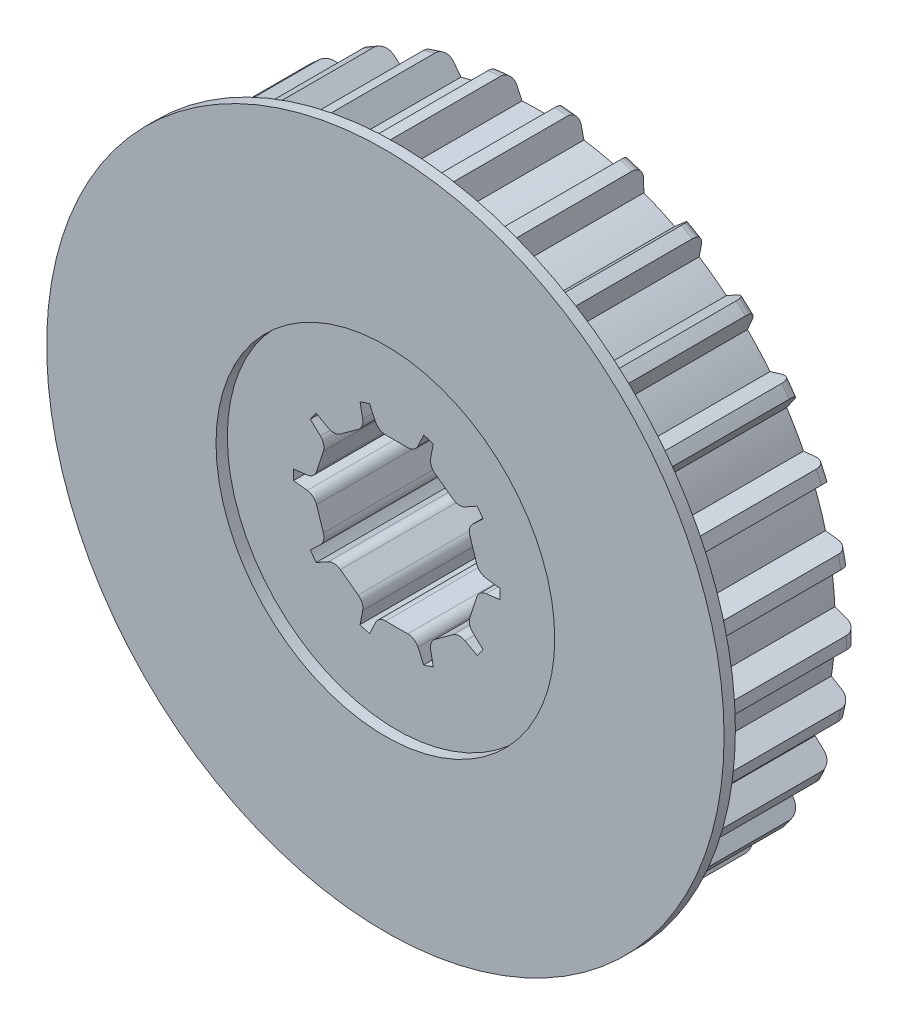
from build123d import *

# Parameters (mm, degrees)
SCHNITT_LINEAR_AUSTRAGEN1_DEPTH = 22.193366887
KREISMUSTER1_COUNT              = 30
AUFSATZ_LINEAR_AUSTRAGEN1_DEPTH = 7.1
VERRUNDUNG1_R                   = 0.5
KREISMUSTER2_COUNT              = 10
VERRUNDUNG1_OF_KREISMUSTER2_R   = 0.5
VERRUNDUNG2_R                   = 0.5


with BuildPart() as part:
    # Skizze1 → Rotation1 (revolve)
    with BuildSketch(Plane(origin=(0, 0, 0), x_dir=(0, 0, -1), z_dir=(1, 0, 0)), mode=Mode.PRIVATE) as rotation1_sk:
        with BuildLine():
            Line((0, 4.57), (0, 14.12))
            Line((0, 14.12), (5.8, 14.12))
            ThreePointArc((5.8, 14.12), (6.153553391, 13.973553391), (6.3, 13.62))
            Line((6.3, 13.62), (6.3, 6.1))
            Line((6.3, 6.1), (7.1, 6.1))
            Line((7.1, 6.1), (7.1, 4.57))
            Line((7.1, 4.57), (0, 4.57))
        make_face()
    revolve(rotation1_sk.sketch.rotate(Axis((0, 0, 33.276923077), (0, 0, -1)), 90), axis=Axis((0, 0, 33.276923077), (0, 0, -1)))

    # Skizze2 → Schnitt-Linear austragen1 (cut, through all)
    with BuildSketch(Plane.XY):
        with BuildLine():
            Line((0.747573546, 13.09868443), (1.2, 14.068916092))
            ThreePointArc((1.2, 14.068916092), (0, 14.12), (-1.2, 14.068916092))
            Line((-1.2, 14.068916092), (-0.747573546, 13.09868443))
            ThreePointArc((-0.747573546, 13.09868443), (0, 13.12), (0.747573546, 13.09868443))
        make_face()
    schnitt_linear_austragen1 = extrude(amount=-SCHNITT_LINEAR_AUSTRAGEN1_DEPTH, mode=Mode.SUBTRACT)

    # Kreismuster1: Schnitt-Linear austragen1 ×30 about axis
    kreismuster1_axis = Axis((0, 0, 0), (0, 0, 1))
    for i in range(1, KREISMUSTER1_COUNT):
        add(schnitt_linear_austragen1.rotate(kreismuster1_axis, i * 360 / KREISMUSTER1_COUNT), mode=Mode.SUBTRACT)

    # Skizze3 → Aufsatz-Linear austragen1 (add)
    with BuildSketch(Plane.XY):
        with BuildLine():
            Line((0.808470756, 3.57), (1.2, 4.409637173))
            ThreePointArc((1.2, 4.409637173), (0, 4.57), (-1.2, 4.409637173))
            Line((-1.2, 4.409637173), (-0.808470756, 3.57))
            Line((-0.808470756, 3.57), (0.808470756, 3.57))
        make_face()
    aufsatz_linear_austragen1 = extrude(amount=-AUFSATZ_LINEAR_AUSTRAGEN1_DEPTH)

    # Verrundung1
    verrundung1_edges = [part.edges().sort_by_distance(p)[0] for p in [
        (0.808470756, 3.57, -3.55),
        (-0.808470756, 3.57, -3.55),
    ]]
    fillet(verrundung1_edges, radius=VERRUNDUNG1_R)

    # Kreismuster2: Aufsatz-Linear austragen1 ×10 about axis
    kreismuster2_axis = Axis((0, 0, 0), (0, 0, 1))
    for i in range(1, KREISMUSTER2_COUNT):
        add(aufsatz_linear_austragen1.rotate(kreismuster2_axis, i * 360 / KREISMUSTER2_COUNT))

    # Verrundung1 of Kreismuster2
    verrundung1_of_kreismuster2_edges = [part.edges().sort_by_distance(p)[0] for p in [
        (-1.44432677, 3.363397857, -3.55),
        (-2.752459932, 2.412983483, -3.55),
        (-3.14544056, 1.872092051, -3.55),
        (-3.645102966, 0.334289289, -3.55),
        (-3.645102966, -0.334289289, -3.55),
        (-3.14544056, -1.872092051, -3.55),
        (-2.752459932, -2.412983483, -3.55),
        (-1.44432677, -3.363397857, -3.55),
        (-0.808470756, -3.57, -3.55),
        (0.808470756, -3.57, -3.55),
        (1.44432677, -3.363397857, -3.55),
        (2.752459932, -2.412983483, -3.55),
        (3.14544056, -1.872092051, -3.55),
        (3.645102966, -0.334289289, -3.55),
        (3.645102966, 0.334289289, -3.55),
        (3.14544056, 1.872092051, -3.55),
        (2.752459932, 2.412983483, -3.55),
        (1.44432677, 3.363397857, -3.55),
    ]]
    fillet(verrundung1_of_kreismuster2_edges, radius=VERRUNDUNG1_OF_KREISMUSTER2_R)

    # Skizze4 → Rotation2 (revolve)
    with BuildSketch(Plane(origin=(0, 0, 0), x_dir=(0, 0, -1), z_dir=(1, 0, 0)), mode=Mode.PRIVATE) as rotation2_sk:
        with BuildLine():
            Line((0, 7.5), (-0.5, 7.5))
            Line((-0.5, 7.5), (-0.5, 15))
            Line((-0.5, 15), (0, 15))
            Line((0, 15), (0, 14.25))
            Line((0, 14.25), (0.653553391, 13.596446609))
            ThreePointArc((0.653553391, 13.596446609), (0.761939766, 13.434234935), (0.8, 13.242893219))
            Line((0.8, 13.242893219), (0.8, 13))
            Line((0.8, 13), (0, 13))
            Line((0, 13), (0, 7.5))
        make_face()
    revolve(rotation2_sk.sketch.rotate(Axis((0, 0, 12.748207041), (0, 0, -1)), 90), axis=Axis((0, 0, 12.748207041), (0, 0, -1)))

    # Skizze5 → Schnitt-Rotation1 (revolve, cut)
    with BuildSketch(Plane(origin=(0, 0, 0), x_dir=(0, 0, -1), z_dir=(1, 0, 0)), mode=Mode.PRIVATE) as schnitt_rotation1_sk:
        Polygon((7.1, 4.2), (6.3, 5), (6.3, 6.1), (7.1, 6.1), align=None)
    revolve(schnitt_rotation1_sk.sketch.rotate(Axis((0, 0, -13.523679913), (0, 0, 1)), 267.223327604), axis=Axis((0, 0, -13.523679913), (0, 0, 1)), mode=Mode.SUBTRACT)

    # Verrundung2
    verrundung2_edges = [part.edges().sort_by_distance(p)[0] for p in [
        (2.46869806, 3.397871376, -7.1),
        (3.994437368, 1.297871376, -7.1),
        (3.994437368, -1.297871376, -7.1),
        (2.46869806, -3.397871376, -7.1),
        (0, -4.2, -7.1),
        (-2.46869806, -3.397871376, -7.1),
        (-3.994437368, -1.297871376, -7.1),
        (-3.994437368, 1.297871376, -7.1),
        (-2.46869806, 3.397871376, -7.1),
        (0, 4.2, -7.1),
    ]]
    fillet(verrundung2_edges, radius=VERRUNDUNG2_R)


solid = part.part
